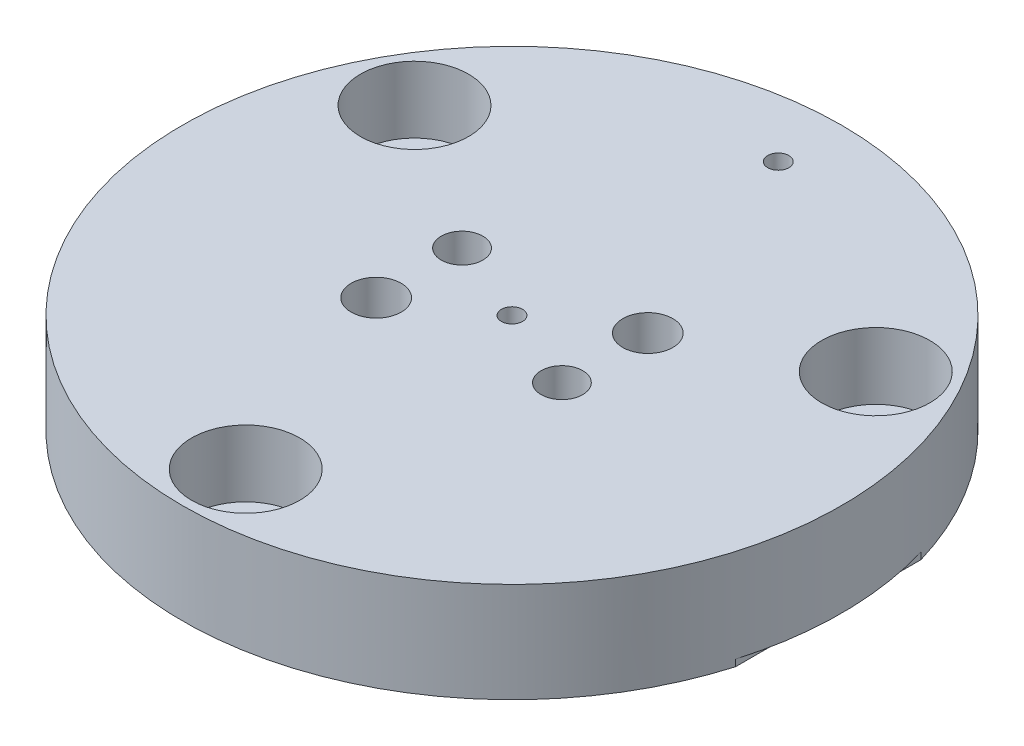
ISO-10303-21;
HEADER;
FILE_DESCRIPTION(('STEP AP214'),'2;1');
FILE_NAME('part.step','',(''),(''),'','','');
FILE_SCHEMA(('AUTOMOTIVE_DESIGN { 1 0 10303 214 1 1 1 1 }'));
ENDSEC;
DATA;
#1=APPLICATION_CONTEXT('core data for automotive mechanical design processes');
#2=APPLICATION_PROTOCOL_DEFINITION('international standard','automotive_design',2000,#1);
#3=PRODUCT_CONTEXT('',#1,'mechanical');
#4=PRODUCT('Part','Part','',(#3));
#5=PRODUCT_RELATED_PRODUCT_CATEGORY('part','',(#4));
#6=PRODUCT_DEFINITION_FORMATION('','',#4);
#7=PRODUCT_DEFINITION_CONTEXT('part definition',#1,'design');
#8=PRODUCT_DEFINITION('design','',#6,#7);
#9=PRODUCT_DEFINITION_SHAPE('','',#8);
#10=(LENGTH_UNIT() NAMED_UNIT(*) SI_UNIT(.MILLI.,.METRE.));
#11=(NAMED_UNIT(*) PLANE_ANGLE_UNIT() SI_UNIT($,.RADIAN.));
#12=(NAMED_UNIT(*) SI_UNIT($,.STERADIAN.) SOLID_ANGLE_UNIT());
#13=UNCERTAINTY_MEASURE_WITH_UNIT(LENGTH_MEASURE(1.E-05),#10,'distance_accuracy_value','');
#14=(GEOMETRIC_REPRESENTATION_CONTEXT(3) GLOBAL_UNCERTAINTY_ASSIGNED_CONTEXT((#13)) GLOBAL_UNIT_ASSIGNED_CONTEXT((#10,
#11,#12)) REPRESENTATION_CONTEXT('',''));
#15=CARTESIAN_POINT('',(0.,0.,0.));
#16=DIRECTION('',(0.,0.,1.));
#17=DIRECTION('',(1.,0.,0.));
#18=AXIS2_PLACEMENT_3D('',#15,#16,#17);
#19=CARTESIAN_POINT('',(0.,7.62,0.));
#20=DIRECTION('',(0.,-1.,0.));
#21=DIRECTION('',(0.,0.,-1.));
#22=AXIS2_PLACEMENT_3D('',#19,#20,#21);
#23=CYLINDRICAL_SURFACE('',#22,2.01929999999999);
#24=CARTESIAN_POINT('',(0.,7.62,0.));
#25=DIRECTION('',(0.,-1.,0.));
#26=DIRECTION('',(0.,0.,-1.));
#27=AXIS2_PLACEMENT_3D('',#24,#25,#26);
#28=CIRCLE('',#27,2.01929999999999);
#29=CARTESIAN_POINT('',(0.,7.62,-2.01929999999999));
#30=VERTEX_POINT('',#29);
#31=EDGE_CURVE('E18',#30,#30,#28,.F.);
#32=ORIENTED_EDGE('',*,*,#31,.F.);
#33=EDGE_LOOP('',(#32));
#34=FACE_BOUND('',#33,.T.);
#35=CARTESIAN_POINT('',(0.,19.05,0.));
#36=DIRECTION('',(0.,-1.,0.));
#37=DIRECTION('',(0.,0.,-1.));
#38=AXIS2_PLACEMENT_3D('',#35,#36,#37);
#39=CIRCLE('',#38,2.01929999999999);
#40=CARTESIAN_POINT('',(0.,19.05,-2.01929999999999));
#41=VERTEX_POINT('',#40);
#42=EDGE_CURVE('E162',#41,#41,#39,.T.);
#43=ORIENTED_EDGE('',*,*,#42,.F.);
#44=EDGE_LOOP('',(#43));
#45=FACE_BOUND('',#44,.T.);
#46=ADVANCED_FACE('F15',(#34,#45),#23,.F.);
#47=CARTESIAN_POINT('',(0.,19.05,50.8));
#48=DIRECTION('',(0.,1.,0.));
#49=DIRECTION('',(0.,0.,1.));
#50=AXIS2_PLACEMENT_3D('',#47,#48,#49);
#51=CYLINDRICAL_SURFACE('',#50,10.31875);
#52=CARTESIAN_POINT('',(0.,6.35,50.8));
#53=DIRECTION('',(0.,1.,0.));
#54=DIRECTION('',(0.,0.,1.));
#55=AXIS2_PLACEMENT_3D('',#52,#53,#54);
#56=CIRCLE('',#55,10.31875);
#57=CARTESIAN_POINT('',(0.,6.35,61.11875));
#58=VERTEX_POINT('',#57);
#59=EDGE_CURVE('E150',#58,#58,#56,.F.);
#60=ORIENTED_EDGE('',*,*,#59,.T.);
#61=EDGE_LOOP('',(#60));
#62=FACE_BOUND('',#61,.T.);
#63=CARTESIAN_POINT('',(0.,19.05,50.8));
#64=DIRECTION('',(0.,1.,0.));
#65=DIRECTION('',(0.,0.,1.));
#66=AXIS2_PLACEMENT_3D('',#63,#64,#65);
#67=CIRCLE('',#66,10.31875);
#68=CARTESIAN_POINT('',(0.,19.05,61.11875));
#69=VERTEX_POINT('',#68);
#70=EDGE_CURVE('E153',#69,#69,#67,.F.);
#71=ORIENTED_EDGE('',*,*,#70,.F.);
#72=EDGE_LOOP('',(#71));
#73=FACE_BOUND('',#72,.T.);
#74=ADVANCED_FACE('F175',(#62,#73),#51,.F.);
#75=CARTESIAN_POINT('',(-43.9940905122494,19.05,-25.4000000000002));
#76=DIRECTION('',(0.,1.,0.));
#77=DIRECTION('',(0.,0.,1.));
#78=AXIS2_PLACEMENT_3D('',#75,#76,#77);
#79=CYLINDRICAL_SURFACE('',#78,10.31875);
#80=CARTESIAN_POINT('',(-43.9940905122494,6.35,-25.4000000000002));
#81=DIRECTION('',(0.,1.,0.));
#82=DIRECTION('',(0.,0.,1.));
#83=AXIS2_PLACEMENT_3D('',#80,#81,#82);
#84=CIRCLE('',#83,10.31875);
#85=CARTESIAN_POINT('',(-43.9940905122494,6.35,-15.0812500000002));
#86=VERTEX_POINT('',#85);
#87=EDGE_CURVE('E147',#86,#86,#84,.F.);
#88=ORIENTED_EDGE('',*,*,#87,.T.);
#89=EDGE_LOOP('',(#88));
#90=FACE_BOUND('',#89,.T.);
#91=CARTESIAN_POINT('',(-43.9940905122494,19.05,-25.4000000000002));
#92=DIRECTION('',(0.,1.,0.));
#93=DIRECTION('',(0.,0.,1.));
#94=AXIS2_PLACEMENT_3D('',#91,#92,#93);
#95=CIRCLE('',#94,10.31875);
#96=CARTESIAN_POINT('',(-43.9940905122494,19.05,-15.0812500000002));
#97=VERTEX_POINT('',#96);
#98=EDGE_CURVE('E156',#97,#97,#95,.F.);
#99=ORIENTED_EDGE('',*,*,#98,.F.);
#100=EDGE_LOOP('',(#99));
#101=FACE_BOUND('',#100,.T.);
#102=ADVANCED_FACE('F270',(#90,#101),#79,.F.);
#103=CARTESIAN_POINT('',(43.9940905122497,19.05,-25.3999999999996));
#104=DIRECTION('',(0.,1.,0.));
#105=DIRECTION('',(0.,0.,1.));
#106=AXIS2_PLACEMENT_3D('',#103,#104,#105);
#107=CYLINDRICAL_SURFACE('',#106,10.31875);
#108=CARTESIAN_POINT('',(43.9940905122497,6.35,-25.3999999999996));
#109=DIRECTION('',(0.,1.,0.));
#110=DIRECTION('',(0.,0.,1.));
#111=AXIS2_PLACEMENT_3D('',#108,#109,#110);
#112=CIRCLE('',#111,10.31875);
#113=CARTESIAN_POINT('',(43.9940905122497,6.35,-15.0812499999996));
#114=VERTEX_POINT('',#113);
#115=EDGE_CURVE('E144',#114,#114,#112,.F.);
#116=ORIENTED_EDGE('',*,*,#115,.T.);
#117=EDGE_LOOP('',(#116));
#118=FACE_BOUND('',#117,.T.);
#119=CARTESIAN_POINT('',(43.9940905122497,19.05,-25.3999999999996));
#120=DIRECTION('',(0.,1.,0.));
#121=DIRECTION('',(0.,0.,1.));
#122=AXIS2_PLACEMENT_3D('',#119,#120,#121);
#123=CIRCLE('',#122,10.31875);
#124=CARTESIAN_POINT('',(43.9940905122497,19.05,-15.0812499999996));
#125=VERTEX_POINT('',#124);
#126=EDGE_CURVE('E159',#125,#125,#123,.F.);
#127=ORIENTED_EDGE('',*,*,#126,.F.);
#128=EDGE_LOOP('',(#127));
#129=FACE_BOUND('',#128,.T.);
#130=ADVANCED_FACE('F289',(#118,#129),#107,.F.);
#131=CARTESIAN_POINT('',(0.,4.318,-50.8));
#132=DIRECTION('',(0.,-1.,0.));
#133=DIRECTION('',(0.,0.,-1.));
#134=AXIS2_PLACEMENT_3D('',#131,#132,#133);
#135=CYLINDRICAL_SURFACE('',#134,2.01929999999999);
#136=CARTESIAN_POINT('',(0.,19.05,-50.8));
#137=DIRECTION('',(0.,-1.,0.));
#138=DIRECTION('',(0.,0.,-1.));
#139=AXIS2_PLACEMENT_3D('',#136,#137,#138);
#140=CIRCLE('',#139,2.01929999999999);
#141=CARTESIAN_POINT('',(0.,19.05,-52.8193));
#142=VERTEX_POINT('',#141);
#143=EDGE_CURVE('E164',#142,#142,#140,.T.);
#144=ORIENTED_EDGE('',*,*,#143,.F.);
#145=EDGE_LOOP('',(#144));
#146=FACE_BOUND('',#145,.T.);
#147=CARTESIAN_POINT('',(0.,4.318,-50.8));
#148=DIRECTION('',(0.,-1.,0.));
#149=DIRECTION('',(0.,0.,-1.));
#150=AXIS2_PLACEMENT_3D('',#147,#148,#149);
#151=CIRCLE('',#150,2.01929999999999);
#152=CARTESIAN_POINT('',(0.,4.318,-52.8193));
#153=VERTEX_POINT('',#152);
#154=EDGE_CURVE('E141',#153,#153,#151,.T.);
#155=ORIENTED_EDGE('',*,*,#154,.T.);
#156=EDGE_LOOP('',(#155));
#157=FACE_BOUND('',#156,.T.);
#158=ADVANCED_FACE('F291',(#146,#157),#135,.F.);
#159=CARTESIAN_POINT('',(0.,7.62,0.));
#160=DIRECTION('',(0.,-1.,0.));
#161=DIRECTION('',(0.,0.,-1.));
#162=AXIS2_PLACEMENT_3D('',#159,#160,#161);
#163=PLANE('',#162);
#164=CARTESIAN_POINT('',(0.,7.62,0.));
#165=DIRECTION('',(0.,-1.,0.));
#166=DIRECTION('',(0.,0.,-1.));
#167=AXIS2_PLACEMENT_3D('',#164,#165,#166);
#168=CIRCLE('',#167,4.7752);
#169=CARTESIAN_POINT('',(0.,7.62,-4.7752));
#170=VERTEX_POINT('',#169);
#171=EDGE_CURVE('E138',#170,#170,#168,.T.);
#172=ORIENTED_EDGE('',*,*,#171,.T.);
#173=EDGE_LOOP('',(#172));
#174=FACE_BOUND('',#173,.T.);
#175=ORIENTED_EDGE('',*,*,#31,.T.);
#176=EDGE_LOOP('',(#175));
#177=FACE_BOUND('',#176,.T.);
#178=ADVANCED_FACE('F171',(#174,#177),#163,.T.);
#179=CARTESIAN_POINT('',(0.,1.27,0.));
#180=DIRECTION('',(0.,-1.,0.));
#181=DIRECTION('',(0.,0.,-1.));
#182=AXIS2_PLACEMENT_3D('',#179,#180,#181);
#183=PLANE('',#182);
#184=CARTESIAN_POINT('',(0.,1.27,0.));
#185=DIRECTION('',(0.,-1.,0.));
#186=DIRECTION('',(0.,0.,-1.));
#187=AXIS2_PLACEMENT_3D('',#184,#185,#186);
#188=CIRCLE('',#187,62.865);
#189=CARTESIAN_POINT('',(-60.325,1.27,-17.6890531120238));
#190=VERTEX_POINT('',#189);
#191=CARTESIAN_POINT('',(-60.325,1.27,17.6890531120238));
#192=VERTEX_POINT('',#191);
#193=EDGE_CURVE('E59',#190,#192,#188,.F.);
#194=ORIENTED_EDGE('',*,*,#193,.F.);
#195=DIRECTION('',(0.,0.,-1.));
#196=VECTOR('',#195,1.);
#197=CARTESIAN_POINT('',(-60.325,1.27,17.6890531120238));
#198=LINE('',#197,#196);
#199=EDGE_CURVE('E54',#190,#192,#198,.F.);
#200=ORIENTED_EDGE('',*,*,#199,.T.);
#201=EDGE_LOOP('',(#194,#200));
#202=FACE_BOUND('',#201,.T.);
#203=ADVANCED_FACE('F67',(#202),#183,.T.);
#204=CARTESIAN_POINT('',(0.,19.05,0.));
#205=DIRECTION('',(0.,1.,0.));
#206=DIRECTION('',(0.,0.,1.));
#207=AXIS2_PLACEMENT_3D('',#204,#205,#206);
#208=PLANE('',#207);
#209=CARTESIAN_POINT('',(0.,19.05,0.));
#210=DIRECTION('',(0.,-1.,0.));
#211=DIRECTION('',(0.,0.,-1.));
#212=AXIS2_PLACEMENT_3D('',#209,#210,#211);
#213=CIRCLE('',#212,62.865);
#214=CARTESIAN_POINT('',(0.,19.05,-62.865));
#215=VERTEX_POINT('',#214);
#216=EDGE_CURVE('E76',#215,#215,#213,.T.);
#217=ORIENTED_EDGE('',*,*,#216,.F.);
#218=EDGE_LOOP('',(#217));
#219=FACE_BOUND('',#218,.T.);
#220=ORIENTED_EDGE('',*,*,#70,.T.);
#221=EDGE_LOOP('',(#220));
#222=FACE_BOUND('',#221,.T.);
#223=ORIENTED_EDGE('',*,*,#98,.T.);
#224=EDGE_LOOP('',(#223));
#225=FACE_BOUND('',#224,.T.);
#226=ORIENTED_EDGE('',*,*,#126,.T.);
#227=EDGE_LOOP('',(#226));
#228=FACE_BOUND('',#227,.T.);
#229=CARTESIAN_POINT('',(15.875,19.05,6.35));
#230=DIRECTION('',(0.,1.,0.));
#231=DIRECTION('',(0.,0.,1.));
#232=AXIS2_PLACEMENT_3D('',#229,#230,#231);
#233=CIRCLE('',#232,3.96874999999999);
#234=CARTESIAN_POINT('',(15.875,19.05,10.31875));
#235=VERTEX_POINT('',#234);
#236=EDGE_CURVE('E68',#235,#235,#233,.F.);
#237=ORIENTED_EDGE('',*,*,#236,.T.);
#238=EDGE_LOOP('',(#237));
#239=FACE_BOUND('',#238,.T.);
#240=CARTESIAN_POINT('',(-15.875,19.05,-6.35));
#241=DIRECTION('',(0.,1.,0.));
#242=DIRECTION('',(0.,0.,1.));
#243=AXIS2_PLACEMENT_3D('',#240,#241,#242);
#244=CIRCLE('',#243,3.96874999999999);
#245=CARTESIAN_POINT('',(-15.875,19.05,-2.38125000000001));
#246=VERTEX_POINT('',#245);
#247=EDGE_CURVE('E129',#246,#246,#244,.F.);
#248=ORIENTED_EDGE('',*,*,#247,.T.);
#249=EDGE_LOOP('',(#248));
#250=FACE_BOUND('',#249,.T.);
#251=CARTESIAN_POINT('',(-15.875,19.05,10.033));
#252=DIRECTION('',(0.,1.,0.));
#253=DIRECTION('',(0.,0.,1.));
#254=AXIS2_PLACEMENT_3D('',#251,#252,#253);
#255=CIRCLE('',#254,4.7752);
#256=CARTESIAN_POINT('',(-15.875,19.05,14.8082));
#257=VERTEX_POINT('',#256);
#258=EDGE_CURVE('E132',#257,#257,#255,.F.);
#259=ORIENTED_EDGE('',*,*,#258,.T.);
#260=EDGE_LOOP('',(#259));
#261=FACE_BOUND('',#260,.T.);
#262=CARTESIAN_POINT('',(15.875,19.05,-10.033));
#263=DIRECTION('',(0.,1.,0.));
#264=DIRECTION('',(0.,0.,1.));
#265=AXIS2_PLACEMENT_3D('',#262,#263,#264);
#266=CIRCLE('',#265,4.7752);
#267=CARTESIAN_POINT('',(15.875,19.05,-5.25780000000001));
#268=VERTEX_POINT('',#267);
#269=EDGE_CURVE('E135',#268,#268,#266,.F.);
#270=ORIENTED_EDGE('',*,*,#269,.T.);
#271=EDGE_LOOP('',(#270));
#272=FACE_BOUND('',#271,.T.);
#273=ORIENTED_EDGE('',*,*,#42,.T.);
#274=EDGE_LOOP('',(#273));
#275=FACE_BOUND('',#274,.T.);
#276=ORIENTED_EDGE('',*,*,#143,.T.);
#277=EDGE_LOOP('',(#276));
#278=FACE_BOUND('',#277,.T.);
#279=ADVANCED_FACE('F178',(#219,#222,#225,#228,#239,#250,#261,#272,#275,#278),#208,.T.);
#280=CARTESIAN_POINT('',(0.,1.27,0.));
#281=DIRECTION('',(0.,-1.,0.));
#282=DIRECTION('',(0.,0.,-1.));
#283=AXIS2_PLACEMENT_3D('',#280,#281,#282);
#284=PLANE('',#283);
#285=CARTESIAN_POINT('',(0.,1.27,0.));
#286=DIRECTION('',(0.,-1.,0.));
#287=DIRECTION('',(0.,0.,-1.));
#288=AXIS2_PLACEMENT_3D('',#285,#286,#287);
#289=CIRCLE('',#288,62.865);
#290=CARTESIAN_POINT('',(60.325,1.27,17.6890531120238));
#291=VERTEX_POINT('',#290);
#292=CARTESIAN_POINT('',(60.325,1.27,-17.6890531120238));
#293=VERTEX_POINT('',#292);
#294=EDGE_CURVE('E123',#291,#293,#289,.F.);
#295=ORIENTED_EDGE('',*,*,#294,.F.);
#296=DIRECTION('',(0.,0.,1.));
#297=VECTOR('',#296,1.);
#298=CARTESIAN_POINT('',(60.325,1.27,17.6890531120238));
#299=LINE('',#298,#297);
#300=EDGE_CURVE('E73',#291,#293,#299,.F.);
#301=ORIENTED_EDGE('',*,*,#300,.T.);
#302=EDGE_LOOP('',(#295,#301));
#303=FACE_BOUND('',#302,.T.);
#304=ADVANCED_FACE('F180',(#303),#284,.T.);
#305=CARTESIAN_POINT('',(6.74624,6.35,50.8));
#306=DIRECTION('',(0.,-1.,0.));
#307=DIRECTION('',(0.,0.,-1.));
#308=AXIS2_PLACEMENT_3D('',#305,#306,#307);
#309=PLANE('',#308);
#310=ORIENTED_EDGE('',*,*,#59,.F.);
#311=EDGE_LOOP('',(#310));
#312=FACE_BOUND('',#311,.T.);
#313=CARTESIAN_POINT('',(0.,6.35,50.8));
#314=DIRECTION('',(0.,1.,0.));
#315=DIRECTION('',(0.,0.,1.));
#316=AXIS2_PLACEMENT_3D('',#313,#314,#315);
#317=CIRCLE('',#316,6.74624);
#318=CARTESIAN_POINT('',(0.,6.35,57.54624));
#319=VERTEX_POINT('',#318);
#320=EDGE_CURVE('E119',#319,#319,#317,.F.);
#321=ORIENTED_EDGE('',*,*,#320,.T.);
#322=EDGE_LOOP('',(#321));
#323=FACE_BOUND('',#322,.T.);
#324=ADVANCED_FACE('F188',(#312,#323),#309,.F.);
#325=CARTESIAN_POINT('',(-47.3672105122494,6.35,-19.5575847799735));
#326=DIRECTION('',(0.,-1.,0.));
#327=DIRECTION('',(0.,0.,-1.));
#328=AXIS2_PLACEMENT_3D('',#325,#326,#327);
#329=PLANE('',#328);
#330=ORIENTED_EDGE('',*,*,#87,.F.);
#331=EDGE_LOOP('',(#330));
#332=FACE_BOUND('',#331,.T.);
#333=CARTESIAN_POINT('',(-43.9940905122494,6.35,-25.4000000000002));
#334=DIRECTION('',(0.,1.,0.));
#335=DIRECTION('',(0.,0.,1.));
#336=AXIS2_PLACEMENT_3D('',#333,#334,#335);
#337=CIRCLE('',#336,6.74624);
#338=CARTESIAN_POINT('',(-43.9940905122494,6.35,-18.6537600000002));
#339=VERTEX_POINT('',#338);
#340=EDGE_CURVE('E116',#339,#339,#337,.F.);
#341=ORIENTED_EDGE('',*,*,#340,.T.);
#342=EDGE_LOOP('',(#341));
#343=FACE_BOUND('',#342,.T.);
#344=ADVANCED_FACE('F254',(#332,#343),#329,.F.);
#345=CARTESIAN_POINT('',(40.6209705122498,6.35,-31.2424152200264));
#346=DIRECTION('',(0.,-1.,0.));
#347=DIRECTION('',(0.,0.,-1.));
#348=AXIS2_PLACEMENT_3D('',#345,#346,#347);
#349=PLANE('',#348);
#350=ORIENTED_EDGE('',*,*,#115,.F.);
#351=EDGE_LOOP('',(#350));
#352=FACE_BOUND('',#351,.T.);
#353=CARTESIAN_POINT('',(43.9940905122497,6.35,-25.3999999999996));
#354=DIRECTION('',(0.,1.,0.));
#355=DIRECTION('',(0.,0.,1.));
#356=AXIS2_PLACEMENT_3D('',#353,#354,#355);
#357=CIRCLE('',#356,6.74624);
#358=CARTESIAN_POINT('',(43.9940905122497,6.35,-18.6537599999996));
#359=VERTEX_POINT('',#358);
#360=EDGE_CURVE('E113',#359,#359,#357,.F.);
#361=ORIENTED_EDGE('',*,*,#360,.T.);
#362=EDGE_LOOP('',(#361));
#363=FACE_BOUND('',#362,.T.);
#364=ADVANCED_FACE('F250',(#352,#363),#349,.F.);
#365=CARTESIAN_POINT('',(0.,4.318,-50.8));
#366=DIRECTION('',(0.,1.,0.));
#367=DIRECTION('',(0.,0.,1.));
#368=AXIS2_PLACEMENT_3D('',#365,#366,#367);
#369=PLANE('',#368);
#370=CARTESIAN_POINT('',(0.,4.318,-50.8));
#371=DIRECTION('',(0.,-1.,0.));
#372=DIRECTION('',(0.,0.,-1.));
#373=AXIS2_PLACEMENT_3D('',#370,#371,#372);
#374=CIRCLE('',#373,3.1877);
#375=CARTESIAN_POINT('',(0.,4.318,-53.9877));
#376=VERTEX_POINT('',#375);
#377=EDGE_CURVE('E110',#376,#376,#374,.T.);
#378=ORIENTED_EDGE('',*,*,#377,.T.);
#379=EDGE_LOOP('',(#378));
#380=FACE_BOUND('',#379,.T.);
#381=ORIENTED_EDGE('',*,*,#154,.F.);
#382=EDGE_LOOP('',(#381));
#383=FACE_BOUND('',#382,.T.);
#384=ADVANCED_FACE('F246',(#380,#383),#369,.F.);
#385=CARTESIAN_POINT('',(0.,7.62,0.));
#386=DIRECTION('',(0.,-1.,0.));
#387=DIRECTION('',(0.,0.,-1.));
#388=AXIS2_PLACEMENT_3D('',#385,#386,#387);
#389=CYLINDRICAL_SURFACE('',#388,4.7752);
#390=ORIENTED_EDGE('',*,*,#171,.F.);
#391=EDGE_LOOP('',(#390));
#392=FACE_BOUND('',#391,.T.);
#393=CARTESIAN_POINT('',(0.,0.,0.));
#394=DIRECTION('',(0.,-1.,0.));
#395=DIRECTION('',(0.,0.,-1.));
#396=AXIS2_PLACEMENT_3D('',#393,#394,#395);
#397=CIRCLE('',#396,4.7752);
#398=CARTESIAN_POINT('',(0.,0.,-4.7752));
#399=VERTEX_POINT('',#398);
#400=EDGE_CURVE('E107',#399,#399,#397,.T.);
#401=ORIENTED_EDGE('',*,*,#400,.T.);
#402=EDGE_LOOP('',(#401));
#403=FACE_BOUND('',#402,.T.);
#404=ADVANCED_FACE('F242',(#392,#403),#389,.F.);
#405=CARTESIAN_POINT('',(15.875,0.,-10.033));
#406=DIRECTION('',(0.,1.,0.));
#407=DIRECTION('',(0.,0.,1.));
#408=AXIS2_PLACEMENT_3D('',#405,#406,#407);
#409=CYLINDRICAL_SURFACE('',#408,4.7752);
#410=CARTESIAN_POINT('',(15.875,0.,-10.033));
#411=DIRECTION('',(0.,1.,0.));
#412=DIRECTION('',(0.,0.,1.));
#413=AXIS2_PLACEMENT_3D('',#410,#411,#412);
#414=CIRCLE('',#413,4.7752);
#415=CARTESIAN_POINT('',(15.875,0.,-5.25780000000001));
#416=VERTEX_POINT('',#415);
#417=EDGE_CURVE('E104',#416,#416,#414,.F.);
#418=ORIENTED_EDGE('',*,*,#417,.T.);
#419=EDGE_LOOP('',(#418));
#420=FACE_BOUND('',#419,.T.);
#421=ORIENTED_EDGE('',*,*,#269,.F.);
#422=EDGE_LOOP('',(#421));
#423=FACE_BOUND('',#422,.T.);
#424=ADVANCED_FACE('F238',(#420,#423),#409,.F.);
#425=CARTESIAN_POINT('',(-15.875,0.,10.033));
#426=DIRECTION('',(0.,1.,0.));
#427=DIRECTION('',(0.,0.,1.));
#428=AXIS2_PLACEMENT_3D('',#425,#426,#427);
#429=CYLINDRICAL_SURFACE('',#428,4.7752);
#430=CARTESIAN_POINT('',(-15.875,0.,10.033));
#431=DIRECTION('',(0.,1.,0.));
#432=DIRECTION('',(0.,0.,1.));
#433=AXIS2_PLACEMENT_3D('',#430,#431,#432);
#434=CIRCLE('',#433,4.7752);
#435=CARTESIAN_POINT('',(-15.875,0.,14.8082));
#436=VERTEX_POINT('',#435);
#437=EDGE_CURVE('E101',#436,#436,#434,.F.);
#438=ORIENTED_EDGE('',*,*,#437,.T.);
#439=EDGE_LOOP('',(#438));
#440=FACE_BOUND('',#439,.T.);
#441=ORIENTED_EDGE('',*,*,#258,.F.);
#442=EDGE_LOOP('',(#441));
#443=FACE_BOUND('',#442,.T.);
#444=ADVANCED_FACE('F234',(#440,#443),#429,.F.);
#445=CARTESIAN_POINT('',(-15.875,19.05,-6.35));
#446=DIRECTION('',(0.,1.,0.));
#447=DIRECTION('',(0.,0.,1.));
#448=AXIS2_PLACEMENT_3D('',#445,#446,#447);
#449=CYLINDRICAL_SURFACE('',#448,3.96874999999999);
#450=CARTESIAN_POINT('',(-15.875,0.,-6.35));
#451=DIRECTION('',(0.,1.,0.));
#452=DIRECTION('',(0.,0.,1.));
#453=AXIS2_PLACEMENT_3D('',#450,#451,#452);
#454=CIRCLE('',#453,3.96874999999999);
#455=CARTESIAN_POINT('',(-15.875,0.,-2.38125000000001));
#456=VERTEX_POINT('',#455);
#457=EDGE_CURVE('E98',#456,#456,#454,.F.);
#458=ORIENTED_EDGE('',*,*,#457,.T.);
#459=EDGE_LOOP('',(#458));
#460=FACE_BOUND('',#459,.T.);
#461=ORIENTED_EDGE('',*,*,#247,.F.);
#462=EDGE_LOOP('',(#461));
#463=FACE_BOUND('',#462,.T.);
#464=ADVANCED_FACE('F230',(#460,#463),#449,.F.);
#465=CARTESIAN_POINT('',(15.875,19.05,6.35));
#466=DIRECTION('',(0.,1.,0.));
#467=DIRECTION('',(0.,0.,1.));
#468=AXIS2_PLACEMENT_3D('',#465,#466,#467);
#469=CYLINDRICAL_SURFACE('',#468,3.96874999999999);
#470=CARTESIAN_POINT('',(15.875,0.,6.35));
#471=DIRECTION('',(0.,1.,0.));
#472=DIRECTION('',(0.,0.,1.));
#473=AXIS2_PLACEMENT_3D('',#470,#471,#472);
#474=CIRCLE('',#473,3.96874999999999);
#475=CARTESIAN_POINT('',(15.875,0.,10.31875));
#476=VERTEX_POINT('',#475);
#477=EDGE_CURVE('E95',#476,#476,#474,.F.);
#478=ORIENTED_EDGE('',*,*,#477,.T.);
#479=EDGE_LOOP('',(#478));
#480=FACE_BOUND('',#479,.T.);
#481=ORIENTED_EDGE('',*,*,#236,.F.);
#482=EDGE_LOOP('',(#481));
#483=FACE_BOUND('',#482,.T.);
#484=ADVANCED_FACE('F227',(#480,#483),#469,.F.);
#485=CARTESIAN_POINT('',(-60.325,1.27,17.6890531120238));
#486=DIRECTION('',(1.,0.,0.));
#487=DIRECTION('',(0.,0.,-1.));
#488=AXIS2_PLACEMENT_3D('',#485,#486,#487);
#489=PLANE('',#488);
#490=DIRECTION('',(0.,-1.,0.));
#491=VECTOR('',#490,1.);
#492=CARTESIAN_POINT('',(-60.325,19.05,17.6890531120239));
#493=LINE('',#492,#491);
#494=CARTESIAN_POINT('',(-60.325,0.,17.6890531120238));
#495=VERTEX_POINT('',#494);
#496=EDGE_CURVE('E62',#192,#495,#493,.T.);
#497=ORIENTED_EDGE('',*,*,#496,.F.);
#498=ORIENTED_EDGE('',*,*,#199,.F.);
#499=DIRECTION('',(0.,-1.,0.));
#500=VECTOR('',#499,1.);
#501=CARTESIAN_POINT('',(-60.325,19.05,-17.6890531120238));
#502=LINE('',#501,#500);
#503=CARTESIAN_POINT('',(-60.325,0.,-17.6890531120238));
#504=VERTEX_POINT('',#503);
#505=EDGE_CURVE('E64',#504,#190,#502,.F.);
#506=ORIENTED_EDGE('',*,*,#505,.F.);
#507=DIRECTION('',(0.,0.,1.));
#508=VECTOR('',#507,1.);
#509=CARTESIAN_POINT('',(-60.325,0.,0.));
#510=LINE('',#509,#508);
#511=EDGE_CURVE('E72',#504,#495,#510,.T.);
#512=ORIENTED_EDGE('',*,*,#511,.T.);
#513=EDGE_LOOP('',(#497,#498,#506,#512));
#514=FACE_BOUND('',#513,.T.);
#515=ADVANCED_FACE('F71',(#514),#489,.F.);
#516=CARTESIAN_POINT('',(60.325,1.27,17.6890531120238));
#517=DIRECTION('',(-1.,0.,0.));
#518=DIRECTION('',(0.,0.,1.));
#519=AXIS2_PLACEMENT_3D('',#516,#517,#518);
#520=PLANE('',#519);
#521=DIRECTION('',(0.,-1.,0.));
#522=VECTOR('',#521,1.);
#523=CARTESIAN_POINT('',(60.325,19.05,-17.6890531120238));
#524=LINE('',#523,#522);
#525=CARTESIAN_POINT('',(60.325,0.,-17.6890531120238));
#526=VERTEX_POINT('',#525);
#527=EDGE_CURVE('E122',#293,#526,#524,.T.);
#528=ORIENTED_EDGE('',*,*,#527,.F.);
#529=ORIENTED_EDGE('',*,*,#300,.F.);
#530=DIRECTION('',(0.,-1.,0.));
#531=VECTOR('',#530,1.);
#532=CARTESIAN_POINT('',(60.325,19.05,17.6890531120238));
#533=LINE('',#532,#531);
#534=CARTESIAN_POINT('',(60.325,0.,17.6890531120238));
#535=VERTEX_POINT('',#534);
#536=EDGE_CURVE('E80',#535,#291,#533,.F.);
#537=ORIENTED_EDGE('',*,*,#536,.F.);
#538=DIRECTION('',(0.,0.,1.));
#539=VECTOR('',#538,1.);
#540=CARTESIAN_POINT('',(60.325,0.,0.));
#541=LINE('',#540,#539);
#542=EDGE_CURVE('E91',#535,#526,#541,.F.);
#543=ORIENTED_EDGE('',*,*,#542,.T.);
#544=EDGE_LOOP('',(#528,#529,#537,#543));
#545=FACE_BOUND('',#544,.T.);
#546=ADVANCED_FACE('F221',(#545),#520,.F.);
#547=CARTESIAN_POINT('',(0.,19.05,0.));
#548=DIRECTION('',(0.,-1.,0.));
#549=DIRECTION('',(0.,0.,-1.));
#550=AXIS2_PLACEMENT_3D('',#547,#548,#549);
#551=CYLINDRICAL_SURFACE('',#550,62.865);
#552=CARTESIAN_POINT('',(0.,0.,0.));
#553=DIRECTION('',(0.,-1.,0.));
#554=DIRECTION('',(0.,0.,-1.));
#555=AXIS2_PLACEMENT_3D('',#552,#553,#554);
#556=CIRCLE('',#555,62.865);
#557=EDGE_CURVE('E92',#495,#535,#556,.F.);
#558=ORIENTED_EDGE('',*,*,#557,.T.);
#559=ORIENTED_EDGE('',*,*,#536,.T.);
#560=ORIENTED_EDGE('',*,*,#294,.T.);
#561=ORIENTED_EDGE('',*,*,#527,.T.);
#562=CARTESIAN_POINT('',(0.,0.,0.));
#563=DIRECTION('',(0.,-1.,0.));
#564=DIRECTION('',(0.,0.,-1.));
#565=AXIS2_PLACEMENT_3D('',#562,#563,#564);
#566=CIRCLE('',#565,62.865);
#567=EDGE_CURVE('E33',#526,#504,#566,.F.);
#568=ORIENTED_EDGE('',*,*,#567,.T.);
#569=ORIENTED_EDGE('',*,*,#505,.T.);
#570=ORIENTED_EDGE('',*,*,#193,.T.);
#571=ORIENTED_EDGE('',*,*,#496,.T.);
#572=EDGE_LOOP('',(#558,#559,#560,#561,#568,#569,#570,#571));
#573=FACE_BOUND('',#572,.T.);
#574=ORIENTED_EDGE('',*,*,#216,.T.);
#575=EDGE_LOOP('',(#574));
#576=FACE_BOUND('',#575,.T.);
#577=ADVANCED_FACE('F60',(#573,#576),#551,.T.);
#578=CARTESIAN_POINT('',(0.,19.05,50.8));
#579=DIRECTION('',(0.,1.,0.));
#580=DIRECTION('',(0.,0.,1.));
#581=AXIS2_PLACEMENT_3D('',#578,#579,#580);
#582=CYLINDRICAL_SURFACE('',#581,6.74624);
#583=CARTESIAN_POINT('',(0.,0.,50.8));
#584=DIRECTION('',(0.,1.,0.));
#585=DIRECTION('',(0.,0.,1.));
#586=AXIS2_PLACEMENT_3D('',#583,#584,#585);
#587=CIRCLE('',#586,6.74624);
#588=CARTESIAN_POINT('',(0.,0.,57.54624));
#589=VERTEX_POINT('',#588);
#590=EDGE_CURVE('E88',#589,#589,#587,.F.);
#591=ORIENTED_EDGE('',*,*,#590,.T.);
#592=EDGE_LOOP('',(#591));
#593=FACE_BOUND('',#592,.T.);
#594=ORIENTED_EDGE('',*,*,#320,.F.);
#595=EDGE_LOOP('',(#594));
#596=FACE_BOUND('',#595,.T.);
#597=ADVANCED_FACE('F214',(#593,#596),#582,.F.);
#598=CARTESIAN_POINT('',(-43.9940905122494,19.05,-25.4000000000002));
#599=DIRECTION('',(0.,1.,0.));
#600=DIRECTION('',(0.,0.,1.));
#601=AXIS2_PLACEMENT_3D('',#598,#599,#600);
#602=CYLINDRICAL_SURFACE('',#601,6.74624);
#603=CARTESIAN_POINT('',(-43.9940905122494,0.,-25.4000000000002));
#604=DIRECTION('',(0.,1.,0.));
#605=DIRECTION('',(0.,0.,1.));
#606=AXIS2_PLACEMENT_3D('',#603,#604,#605);
#607=CIRCLE('',#606,6.74624);
#608=CARTESIAN_POINT('',(-43.9940905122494,0.,-18.6537600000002));
#609=VERTEX_POINT('',#608);
#610=EDGE_CURVE('E85',#609,#609,#607,.F.);
#611=ORIENTED_EDGE('',*,*,#610,.T.);
#612=EDGE_LOOP('',(#611));
#613=FACE_BOUND('',#612,.T.);
#614=ORIENTED_EDGE('',*,*,#340,.F.);
#615=EDGE_LOOP('',(#614));
#616=FACE_BOUND('',#615,.T.);
#617=ADVANCED_FACE('F210',(#613,#616),#602,.F.);
#618=CARTESIAN_POINT('',(43.9940905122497,19.05,-25.3999999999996));
#619=DIRECTION('',(0.,1.,0.));
#620=DIRECTION('',(0.,0.,1.));
#621=AXIS2_PLACEMENT_3D('',#618,#619,#620);
#622=CYLINDRICAL_SURFACE('',#621,6.74624);
#623=CARTESIAN_POINT('',(43.9940905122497,0.,-25.3999999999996));
#624=DIRECTION('',(0.,1.,0.));
#625=DIRECTION('',(0.,0.,1.));
#626=AXIS2_PLACEMENT_3D('',#623,#624,#625);
#627=CIRCLE('',#626,6.74624);
#628=CARTESIAN_POINT('',(43.9940905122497,0.,-18.6537599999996));
#629=VERTEX_POINT('',#628);
#630=EDGE_CURVE('E24',#629,#629,#627,.F.);
#631=ORIENTED_EDGE('',*,*,#630,.T.);
#632=EDGE_LOOP('',(#631));
#633=FACE_BOUND('',#632,.T.);
#634=ORIENTED_EDGE('',*,*,#360,.F.);
#635=EDGE_LOOP('',(#634));
#636=FACE_BOUND('',#635,.T.);
#637=ADVANCED_FACE('F202',(#633,#636),#622,.F.);
#638=CARTESIAN_POINT('',(0.,4.318,-50.8));
#639=DIRECTION('',(0.,-1.,0.));
#640=DIRECTION('',(0.,0.,-1.));
#641=AXIS2_PLACEMENT_3D('',#638,#639,#640);
#642=CYLINDRICAL_SURFACE('',#641,3.1877);
#643=CARTESIAN_POINT('',(0.,0.,-50.8));
#644=DIRECTION('',(0.,-1.,0.));
#645=DIRECTION('',(0.,0.,-1.));
#646=AXIS2_PLACEMENT_3D('',#643,#644,#645);
#647=CIRCLE('',#646,3.1877);
#648=CARTESIAN_POINT('',(0.,0.,-53.9877));
#649=VERTEX_POINT('',#648);
#650=EDGE_CURVE('E10',#649,#649,#647,.T.);
#651=ORIENTED_EDGE('',*,*,#650,.T.);
#652=EDGE_LOOP('',(#651));
#653=FACE_BOUND('',#652,.T.);
#654=ORIENTED_EDGE('',*,*,#377,.F.);
#655=EDGE_LOOP('',(#654));
#656=FACE_BOUND('',#655,.T.);
#657=ADVANCED_FACE('F196',(#653,#656),#642,.F.);
#658=CARTESIAN_POINT('',(0.,0.,0.));
#659=DIRECTION('',(0.,1.,0.));
#660=DIRECTION('',(0.,0.,1.));
#661=AXIS2_PLACEMENT_3D('',#658,#659,#660);
#662=PLANE('',#661);
#663=ORIENTED_EDGE('',*,*,#650,.F.);
#664=EDGE_LOOP('',(#663));
#665=FACE_BOUND('',#664,.T.);
#666=ORIENTED_EDGE('',*,*,#630,.F.);
#667=EDGE_LOOP('',(#666));
#668=FACE_BOUND('',#667,.T.);
#669=ORIENTED_EDGE('',*,*,#610,.F.);
#670=EDGE_LOOP('',(#669));
#671=FACE_BOUND('',#670,.T.);
#672=ORIENTED_EDGE('',*,*,#590,.F.);
#673=EDGE_LOOP('',(#672));
#674=FACE_BOUND('',#673,.T.);
#675=ORIENTED_EDGE('',*,*,#542,.F.);
#676=ORIENTED_EDGE('',*,*,#557,.F.);
#677=ORIENTED_EDGE('',*,*,#511,.F.);
#678=ORIENTED_EDGE('',*,*,#567,.F.);
#679=EDGE_LOOP('',(#675,#676,#677,#678));
#680=FACE_BOUND('',#679,.T.);
#681=ORIENTED_EDGE('',*,*,#477,.F.);
#682=EDGE_LOOP('',(#681));
#683=FACE_BOUND('',#682,.T.);
#684=ORIENTED_EDGE('',*,*,#457,.F.);
#685=EDGE_LOOP('',(#684));
#686=FACE_BOUND('',#685,.T.);
#687=ORIENTED_EDGE('',*,*,#437,.F.);
#688=EDGE_LOOP('',(#687));
#689=FACE_BOUND('',#688,.T.);
#690=ORIENTED_EDGE('',*,*,#417,.F.);
#691=EDGE_LOOP('',(#690));
#692=FACE_BOUND('',#691,.T.);
#693=ORIENTED_EDGE('',*,*,#400,.F.);
#694=EDGE_LOOP('',(#693));
#695=FACE_BOUND('',#694,.T.);
#696=ADVANCED_FACE('F194',(#665,#668,#671,#674,#680,#683,#686,#689,#692,#695),#662,.F.);
#697=CLOSED_SHELL('',(#46,#74,#102,#130,#158,#178,#203,#279,#304,#324,#344,#364,#384,#404,#424,
#444,#464,#484,#515,#546,#577,#597,#617,#637,#657,#696));
#698=MANIFOLD_SOLID_BREP('B1',#697);
#699=ADVANCED_BREP_SHAPE_REPRESENTATION('',(#18,#698),#14);
#700=SHAPE_DEFINITION_REPRESENTATION(#9,#699);
ENDSEC;
END-ISO-10303-21;
